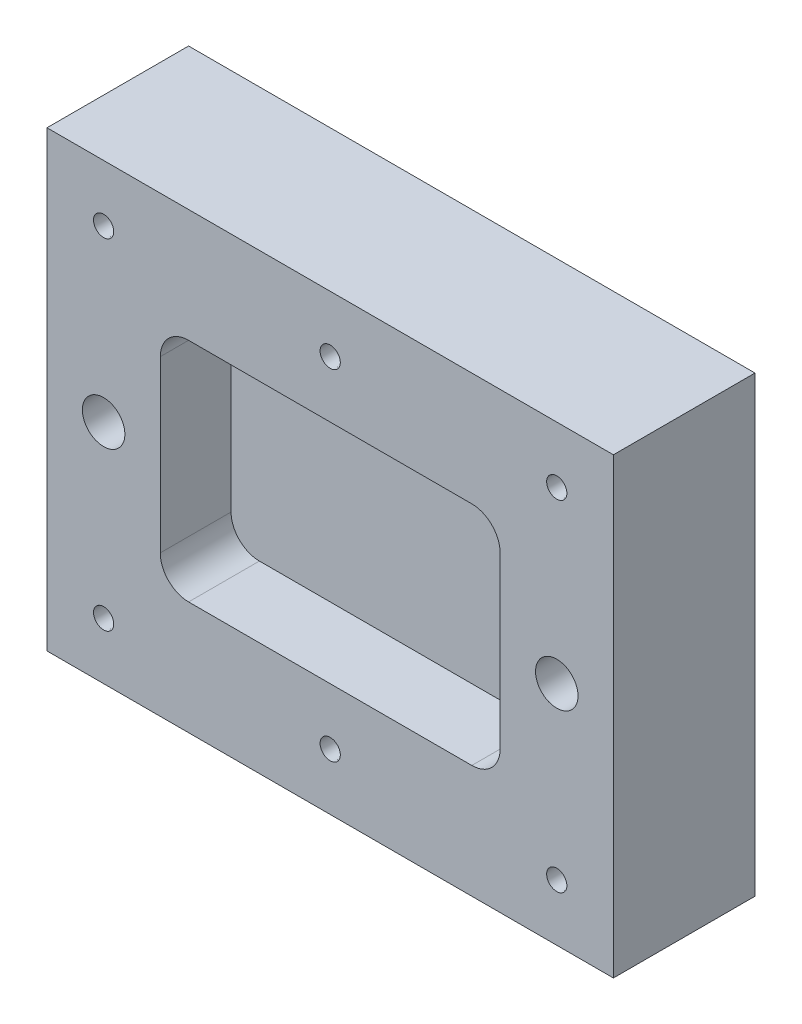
ISO-10303-21;
HEADER;
FILE_DESCRIPTION(('STEP AP214'),'2;1');
FILE_NAME('part.step','',(''),(''),'','','');
FILE_SCHEMA(('AUTOMOTIVE_DESIGN { 1 0 10303 214 1 1 1 1 }'));
ENDSEC;
DATA;
#1=APPLICATION_CONTEXT('core data for automotive mechanical design processes');
#2=APPLICATION_PROTOCOL_DEFINITION('international standard','automotive_design',2000,#1);
#3=PRODUCT_CONTEXT('',#1,'mechanical');
#4=PRODUCT('Part','Part','',(#3));
#5=PRODUCT_RELATED_PRODUCT_CATEGORY('part','',(#4));
#6=PRODUCT_DEFINITION_FORMATION('','',#4);
#7=PRODUCT_DEFINITION_CONTEXT('part definition',#1,'design');
#8=PRODUCT_DEFINITION('design','',#6,#7);
#9=PRODUCT_DEFINITION_SHAPE('','',#8);
#10=(LENGTH_UNIT() NAMED_UNIT(*) SI_UNIT(.MILLI.,.METRE.));
#11=(NAMED_UNIT(*) PLANE_ANGLE_UNIT() SI_UNIT($,.RADIAN.));
#12=(NAMED_UNIT(*) SI_UNIT($,.STERADIAN.) SOLID_ANGLE_UNIT());
#13=UNCERTAINTY_MEASURE_WITH_UNIT(LENGTH_MEASURE(1.E-05),#10,'distance_accuracy_value','');
#14=(GEOMETRIC_REPRESENTATION_CONTEXT(3) GLOBAL_UNCERTAINTY_ASSIGNED_CONTEXT((#13)) GLOBAL_UNIT_ASSIGNED_CONTEXT((#10,
#11,#12)) REPRESENTATION_CONTEXT('',''));
#15=CARTESIAN_POINT('',(0.,0.,0.));
#16=DIRECTION('',(0.,0.,1.));
#17=DIRECTION('',(1.,0.,0.));
#18=AXIS2_PLACEMENT_3D('',#15,#16,#17);
#19=CARTESIAN_POINT('',(-100.,-80.,-50.));
#20=DIRECTION('',(0.,0.,-1.));
#21=DIRECTION('',(-1.,0.,0.));
#22=AXIS2_PLACEMENT_3D('',#19,#20,#21);
#23=PLANE('',#22);
#24=CARTESIAN_POINT('',(-80.,0.,-50.));
#25=DIRECTION('',(0.,0.,1.));
#26=DIRECTION('',(1.,0.,0.));
#27=AXIS2_PLACEMENT_3D('',#24,#25,#26);
#28=CIRCLE('',#27,7.5);
#29=CARTESIAN_POINT('',(-72.5,0.,-50.));
#30=VERTEX_POINT('',#29);
#31=EDGE_CURVE('E1040',#30,#30,#28,.T.);
#32=ORIENTED_EDGE('',*,*,#31,.T.);
#33=EDGE_LOOP('',(#32));
#34=FACE_BOUND('',#33,.T.);
#35=CARTESIAN_POINT('',(80.,0.,-50.));
#36=DIRECTION('',(0.,0.,1.));
#37=DIRECTION('',(1.,0.,0.));
#38=AXIS2_PLACEMENT_3D('',#35,#36,#37);
#39=CIRCLE('',#38,7.5);
#40=CARTESIAN_POINT('',(87.5,0.,-50.));
#41=VERTEX_POINT('',#40);
#42=EDGE_CURVE('E1006',#41,#41,#39,.T.);
#43=ORIENTED_EDGE('',*,*,#42,.T.);
#44=EDGE_LOOP('',(#43));
#45=FACE_BOUND('',#44,.T.);
#46=CARTESIAN_POINT('',(-80.,60.,-50.));
#47=DIRECTION('',(0.,0.,1.));
#48=DIRECTION('',(1.,0.,0.));
#49=AXIS2_PLACEMENT_3D('',#46,#47,#48);
#50=CIRCLE('',#49,3.0734);
#51=CARTESIAN_POINT('',(-76.9266,60.,-50.));
#52=VERTEX_POINT('',#51);
#53=EDGE_CURVE('E287',#52,#52,#50,.T.);
#54=ORIENTED_EDGE('',*,*,#53,.T.);
#55=EDGE_LOOP('',(#54));
#56=FACE_BOUND('',#55,.T.);
#57=CARTESIAN_POINT('',(80.,60.,-50.));
#58=DIRECTION('',(0.,0.,1.));
#59=DIRECTION('',(1.,0.,0.));
#60=AXIS2_PLACEMENT_3D('',#57,#58,#59);
#61=CIRCLE('',#60,3.0734);
#62=CARTESIAN_POINT('',(83.0734,60.,-50.));
#63=VERTEX_POINT('',#62);
#64=EDGE_CURVE('E360',#63,#63,#61,.T.);
#65=ORIENTED_EDGE('',*,*,#64,.T.);
#66=EDGE_LOOP('',(#65));
#67=FACE_BOUND('',#66,.T.);
#68=CARTESIAN_POINT('',(80.,-60.,-50.));
#69=DIRECTION('',(0.,0.,1.));
#70=DIRECTION('',(1.,0.,0.));
#71=AXIS2_PLACEMENT_3D('',#68,#69,#70);
#72=CIRCLE('',#71,3.0734);
#73=CARTESIAN_POINT('',(83.0734,-60.,-50.));
#74=VERTEX_POINT('',#73);
#75=EDGE_CURVE('E342',#74,#74,#72,.T.);
#76=ORIENTED_EDGE('',*,*,#75,.T.);
#77=EDGE_LOOP('',(#76));
#78=FACE_BOUND('',#77,.T.);
#79=DIRECTION('',(0.,-1.,0.));
#80=VECTOR('',#79,1.);
#81=CARTESIAN_POINT('',(-100.,80.,-50.));
#82=LINE('',#81,#80);
#83=CARTESIAN_POINT('',(-100.,80.,-50.));
#84=VERTEX_POINT('',#83);
#85=CARTESIAN_POINT('',(-100.,-80.,-50.));
#86=VERTEX_POINT('',#85);
#87=EDGE_CURVE('E191',#84,#86,#82,.T.);
#88=ORIENTED_EDGE('',*,*,#87,.F.);
#89=DIRECTION('',(1.,0.,0.));
#90=VECTOR('',#89,1.);
#91=CARTESIAN_POINT('',(-100.,80.,-50.));
#92=LINE('',#91,#90);
#93=CARTESIAN_POINT('',(100.,80.,-50.));
#94=VERTEX_POINT('',#93);
#95=EDGE_CURVE('E202',#84,#94,#92,.T.);
#96=ORIENTED_EDGE('',*,*,#95,.T.);
#97=DIRECTION('',(0.,1.,0.));
#98=VECTOR('',#97,1.);
#99=CARTESIAN_POINT('',(100.,-80.,-50.));
#100=LINE('',#99,#98);
#101=CARTESIAN_POINT('',(100.,-80.,-50.));
#102=VERTEX_POINT('',#101);
#103=EDGE_CURVE('E203',#102,#94,#100,.T.);
#104=ORIENTED_EDGE('',*,*,#103,.F.);
#105=DIRECTION('',(-1.,0.,0.));
#106=VECTOR('',#105,1.);
#107=CARTESIAN_POINT('',(100.,-80.,-50.));
#108=LINE('',#107,#106);
#109=EDGE_CURVE('E109',#102,#86,#108,.T.);
#110=ORIENTED_EDGE('',*,*,#109,.T.);
#111=EDGE_LOOP('',(#88,#96,#104,#110));
#112=FACE_BOUND('',#111,.T.);
#113=CARTESIAN_POINT('',(0.,60.,-50.));
#114=DIRECTION('',(0.,0.,1.));
#115=DIRECTION('',(1.,0.,0.));
#116=AXIS2_PLACEMENT_3D('',#113,#114,#115);
#117=CIRCLE('',#116,3.0734);
#118=CARTESIAN_POINT('',(3.07340000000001,60.,-50.));
#119=VERTEX_POINT('',#118);
#120=EDGE_CURVE('E239',#119,#119,#117,.T.);
#121=ORIENTED_EDGE('',*,*,#120,.T.);
#122=EDGE_LOOP('',(#121));
#123=FACE_BOUND('',#122,.T.);
#124=CARTESIAN_POINT('',(0.,-60.,-50.));
#125=DIRECTION('',(0.,0.,1.));
#126=DIRECTION('',(1.,0.,0.));
#127=AXIS2_PLACEMENT_3D('',#124,#125,#126);
#128=CIRCLE('',#127,3.0734);
#129=CARTESIAN_POINT('',(3.07340000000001,-60.,-50.));
#130=VERTEX_POINT('',#129);
#131=EDGE_CURVE('E243',#130,#130,#128,.T.);
#132=ORIENTED_EDGE('',*,*,#131,.T.);
#133=EDGE_LOOP('',(#132));
#134=FACE_BOUND('',#133,.T.);
#135=CARTESIAN_POINT('',(-80.,-60.,-50.));
#136=DIRECTION('',(0.,0.,1.));
#137=DIRECTION('',(1.,0.,0.));
#138=AXIS2_PLACEMENT_3D('',#135,#136,#137);
#139=CIRCLE('',#138,3.0734);
#140=CARTESIAN_POINT('',(-76.9266,-60.,-50.));
#141=VERTEX_POINT('',#140);
#142=EDGE_CURVE('E248',#141,#141,#139,.T.);
#143=ORIENTED_EDGE('',*,*,#142,.T.);
#144=EDGE_LOOP('',(#143));
#145=FACE_BOUND('',#144,.T.);
#146=ADVANCED_FACE('F59',(#34,#45,#56,#67,#78,#112,#123,#134,#145),#23,.T.);
#147=CARTESIAN_POINT('',(-100.,-80.,0.));
#148=DIRECTION('',(0.,0.,-1.));
#149=DIRECTION('',(-1.,0.,0.));
#150=AXIS2_PLACEMENT_3D('',#147,#148,#149);
#151=PLANE('',#150);
#152=CARTESIAN_POINT('',(-80.,0.,0.));
#153=DIRECTION('',(0.,0.,1.));
#154=DIRECTION('',(1.,0.,0.));
#155=AXIS2_PLACEMENT_3D('',#152,#153,#154);
#156=CIRCLE('',#155,7.5);
#157=CARTESIAN_POINT('',(-72.5,0.,0.));
#158=VERTEX_POINT('',#157);
#159=EDGE_CURVE('E1010',#158,#158,#156,.T.);
#160=ORIENTED_EDGE('',*,*,#159,.F.);
#161=EDGE_LOOP('',(#160));
#162=FACE_BOUND('',#161,.T.);
#163=CARTESIAN_POINT('',(80.,0.,0.));
#164=DIRECTION('',(0.,0.,1.));
#165=DIRECTION('',(1.,0.,0.));
#166=AXIS2_PLACEMENT_3D('',#163,#164,#165);
#167=CIRCLE('',#166,7.5);
#168=CARTESIAN_POINT('',(87.5,0.,0.));
#169=VERTEX_POINT('',#168);
#170=EDGE_CURVE('E1004',#169,#169,#167,.T.);
#171=ORIENTED_EDGE('',*,*,#170,.F.);
#172=EDGE_LOOP('',(#171));
#173=FACE_BOUND('',#172,.T.);
#174=CARTESIAN_POINT('',(-80.,60.,0.));
#175=DIRECTION('',(0.,0.,1.));
#176=DIRECTION('',(1.,0.,0.));
#177=AXIS2_PLACEMENT_3D('',#174,#175,#176);
#178=CIRCLE('',#177,3.571113);
#179=CARTESIAN_POINT('',(-76.428887,60.,0.));
#180=VERTEX_POINT('',#179);
#181=EDGE_CURVE('E282',#180,#180,#178,.T.);
#182=ORIENTED_EDGE('',*,*,#181,.F.);
#183=EDGE_LOOP('',(#182));
#184=FACE_BOUND('',#183,.T.);
#185=CARTESIAN_POINT('',(80.,60.,0.));
#186=DIRECTION('',(0.,0.,1.));
#187=DIRECTION('',(1.,0.,0.));
#188=AXIS2_PLACEMENT_3D('',#185,#186,#187);
#189=CIRCLE('',#188,3.571113);
#190=CARTESIAN_POINT('',(83.571113,60.,0.));
#191=VERTEX_POINT('',#190);
#192=EDGE_CURVE('E354',#191,#191,#189,.T.);
#193=ORIENTED_EDGE('',*,*,#192,.F.);
#194=EDGE_LOOP('',(#193));
#195=FACE_BOUND('',#194,.T.);
#196=CARTESIAN_POINT('',(80.,-60.,0.));
#197=DIRECTION('',(0.,0.,1.));
#198=DIRECTION('',(1.,0.,0.));
#199=AXIS2_PLACEMENT_3D('',#196,#197,#198);
#200=CIRCLE('',#199,3.571113);
#201=CARTESIAN_POINT('',(83.571113,-60.,0.));
#202=VERTEX_POINT('',#201);
#203=EDGE_CURVE('E337',#202,#202,#200,.T.);
#204=ORIENTED_EDGE('',*,*,#203,.F.);
#205=EDGE_LOOP('',(#204));
#206=FACE_BOUND('',#205,.T.);
#207=CARTESIAN_POINT('',(-80.,-60.,0.));
#208=DIRECTION('',(0.,0.,1.));
#209=DIRECTION('',(1.,0.,0.));
#210=AXIS2_PLACEMENT_3D('',#207,#208,#209);
#211=CIRCLE('',#210,3.571113);
#212=CARTESIAN_POINT('',(-76.428887,-60.,0.));
#213=VERTEX_POINT('',#212);
#214=EDGE_CURVE('E378',#213,#213,#211,.T.);
#215=ORIENTED_EDGE('',*,*,#214,.F.);
#216=EDGE_LOOP('',(#215));
#217=FACE_BOUND('',#216,.T.);
#218=CARTESIAN_POINT('',(0.,-60.,0.));
#219=DIRECTION('',(0.,0.,1.));
#220=DIRECTION('',(1.,0.,0.));
#221=AXIS2_PLACEMENT_3D('',#218,#219,#220);
#222=CIRCLE('',#221,3.571113);
#223=CARTESIAN_POINT('',(3.57111300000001,-60.,0.));
#224=VERTEX_POINT('',#223);
#225=EDGE_CURVE('E250',#224,#224,#222,.T.);
#226=ORIENTED_EDGE('',*,*,#225,.F.);
#227=EDGE_LOOP('',(#226));
#228=FACE_BOUND('',#227,.T.);
#229=CARTESIAN_POINT('',(0.,60.,0.));
#230=DIRECTION('',(0.,0.,1.));
#231=DIRECTION('',(1.,0.,0.));
#232=AXIS2_PLACEMENT_3D('',#229,#230,#231);
#233=CIRCLE('',#232,3.571113);
#234=CARTESIAN_POINT('',(3.57111300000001,60.,0.));
#235=VERTEX_POINT('',#234);
#236=EDGE_CURVE('E320',#235,#235,#233,.T.);
#237=ORIENTED_EDGE('',*,*,#236,.F.);
#238=EDGE_LOOP('',(#237));
#239=FACE_BOUND('',#238,.T.);
#240=DIRECTION('',(0.,-1.,0.));
#241=VECTOR('',#240,1.);
#242=CARTESIAN_POINT('',(-100.,80.,0.));
#243=LINE('',#242,#241);
#244=CARTESIAN_POINT('',(-100.,80.,0.));
#245=VERTEX_POINT('',#244);
#246=CARTESIAN_POINT('',(-100.,-80.,0.));
#247=VERTEX_POINT('',#246);
#248=EDGE_CURVE('E181',#245,#247,#243,.T.);
#249=ORIENTED_EDGE('',*,*,#248,.T.);
#250=DIRECTION('',(-1.,0.,0.));
#251=VECTOR('',#250,1.);
#252=CARTESIAN_POINT('',(100.,-80.,0.));
#253=LINE('',#252,#251);
#254=CARTESIAN_POINT('',(100.,-80.,0.));
#255=VERTEX_POINT('',#254);
#256=EDGE_CURVE('E189',#255,#247,#253,.T.);
#257=ORIENTED_EDGE('',*,*,#256,.F.);
#258=DIRECTION('',(0.,1.,0.));
#259=VECTOR('',#258,1.);
#260=CARTESIAN_POINT('',(100.,-80.,0.));
#261=LINE('',#260,#259);
#262=CARTESIAN_POINT('',(100.,80.,0.));
#263=VERTEX_POINT('',#262);
#264=EDGE_CURVE('E211',#255,#263,#261,.T.);
#265=ORIENTED_EDGE('',*,*,#264,.T.);
#266=DIRECTION('',(1.,0.,0.));
#267=VECTOR('',#266,1.);
#268=CARTESIAN_POINT('',(-100.,80.,0.));
#269=LINE('',#268,#267);
#270=EDGE_CURVE('E196',#245,#263,#269,.T.);
#271=ORIENTED_EDGE('',*,*,#270,.F.);
#272=EDGE_LOOP('',(#249,#257,#265,#271));
#273=FACE_BOUND('',#272,.T.);
#274=CARTESIAN_POINT('',(-50.,30.,0.));
#275=DIRECTION('',(0.,0.,-1.));
#276=DIRECTION('',(-1.,0.,0.));
#277=AXIS2_PLACEMENT_3D('',#274,#275,#276);
#278=CIRCLE('',#277,10.);
#279=CARTESIAN_POINT('',(-60.,29.9999999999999,0.));
#280=VERTEX_POINT('',#279);
#281=CARTESIAN_POINT('',(-49.9999999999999,40.,0.));
#282=VERTEX_POINT('',#281);
#283=EDGE_CURVE('E77',#280,#282,#278,.T.);
#284=ORIENTED_EDGE('',*,*,#283,.T.);
#285=DIRECTION('',(1.,0.,0.));
#286=VECTOR('',#285,1.);
#287=CARTESIAN_POINT('',(-49.9999999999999,40.,0.));
#288=LINE('',#287,#286);
#289=CARTESIAN_POINT('',(49.9999999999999,40.,0.));
#290=VERTEX_POINT('',#289);
#291=EDGE_CURVE('E182',#282,#290,#288,.T.);
#292=ORIENTED_EDGE('',*,*,#291,.T.);
#293=CARTESIAN_POINT('',(50.,30.,0.));
#294=DIRECTION('',(0.,0.,1.));
#295=DIRECTION('',(1.,0.,0.));
#296=AXIS2_PLACEMENT_3D('',#293,#294,#295);
#297=CIRCLE('',#296,10.);
#298=CARTESIAN_POINT('',(60.,29.9999999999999,0.));
#299=VERTEX_POINT('',#298);
#300=EDGE_CURVE('E392',#299,#290,#297,.T.);
#301=ORIENTED_EDGE('',*,*,#300,.F.);
#302=DIRECTION('',(0.,1.,0.));
#303=VECTOR('',#302,1.);
#304=CARTESIAN_POINT('',(60.,-29.9999999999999,0.));
#305=LINE('',#304,#303);
#306=CARTESIAN_POINT('',(60.,-29.9999999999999,0.));
#307=VERTEX_POINT('',#306);
#308=EDGE_CURVE('E391',#307,#299,#305,.T.);
#309=ORIENTED_EDGE('',*,*,#308,.F.);
#310=CARTESIAN_POINT('',(50.,-30.,0.));
#311=DIRECTION('',(0.,0.,-1.));
#312=DIRECTION('',(-1.,0.,0.));
#313=AXIS2_PLACEMENT_3D('',#310,#311,#312);
#314=CIRCLE('',#313,10.);
#315=CARTESIAN_POINT('',(49.9999999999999,-40.,0.));
#316=VERTEX_POINT('',#315);
#317=EDGE_CURVE('E400',#307,#316,#314,.T.);
#318=ORIENTED_EDGE('',*,*,#317,.T.);
#319=DIRECTION('',(-1.,0.,0.));
#320=VECTOR('',#319,1.);
#321=CARTESIAN_POINT('',(49.9999999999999,-40.,0.));
#322=LINE('',#321,#320);
#323=CARTESIAN_POINT('',(-49.9999999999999,-40.,0.));
#324=VERTEX_POINT('',#323);
#325=EDGE_CURVE('E401',#316,#324,#322,.T.);
#326=ORIENTED_EDGE('',*,*,#325,.T.);
#327=CARTESIAN_POINT('',(-50.,-30.,0.));
#328=DIRECTION('',(0.,0.,-1.));
#329=DIRECTION('',(-1.,0.,0.));
#330=AXIS2_PLACEMENT_3D('',#327,#328,#329);
#331=CIRCLE('',#330,10.);
#332=CARTESIAN_POINT('',(-60.,-29.9999999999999,0.));
#333=VERTEX_POINT('',#332);
#334=EDGE_CURVE('E410',#324,#333,#331,.T.);
#335=ORIENTED_EDGE('',*,*,#334,.T.);
#336=DIRECTION('',(0.,-1.,0.));
#337=VECTOR('',#336,1.);
#338=CARTESIAN_POINT('',(-60.,29.9999999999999,0.));
#339=LINE('',#338,#337);
#340=EDGE_CURVE('E179',#280,#333,#339,.T.);
#341=ORIENTED_EDGE('',*,*,#340,.F.);
#342=EDGE_LOOP('',(#284,#292,#301,#309,#318,#326,#335,#341));
#343=FACE_BOUND('',#342,.T.);
#344=ADVANCED_FACE('F227',(#162,#173,#184,#195,#206,#217,#228,#239,#273,#343),#151,.F.);
#345=CARTESIAN_POINT('',(-100.,80.,-50.));
#346=DIRECTION('',(-1.,0.,0.));
#347=DIRECTION('',(0.,0.,1.));
#348=AXIS2_PLACEMENT_3D('',#345,#346,#347);
#349=PLANE('',#348);
#350=ORIENTED_EDGE('',*,*,#248,.F.);
#351=DIRECTION('',(0.,0.,1.));
#352=VECTOR('',#351,1.);
#353=CARTESIAN_POINT('',(-100.,80.,-50.));
#354=LINE('',#353,#352);
#355=EDGE_CURVE('E12',#84,#245,#354,.T.);
#356=ORIENTED_EDGE('',*,*,#355,.F.);
#357=ORIENTED_EDGE('',*,*,#87,.T.);
#358=DIRECTION('',(0.,0.,1.));
#359=VECTOR('',#358,1.);
#360=CARTESIAN_POINT('',(-100.,-80.,-50.));
#361=LINE('',#360,#359);
#362=EDGE_CURVE('E65',#86,#247,#361,.T.);
#363=ORIENTED_EDGE('',*,*,#362,.T.);
#364=EDGE_LOOP('',(#350,#356,#357,#363));
#365=FACE_BOUND('',#364,.T.);
#366=ADVANCED_FACE('F58',(#365),#349,.T.);
#367=CARTESIAN_POINT('',(-100.,80.,-50.));
#368=DIRECTION('',(0.,-1.,0.));
#369=DIRECTION('',(0.,0.,-1.));
#370=AXIS2_PLACEMENT_3D('',#367,#368,#369);
#371=PLANE('',#370);
#372=ORIENTED_EDGE('',*,*,#270,.T.);
#373=DIRECTION('',(0.,0.,1.));
#374=VECTOR('',#373,1.);
#375=CARTESIAN_POINT('',(100.,80.,-50.));
#376=LINE('',#375,#374);
#377=EDGE_CURVE('E67',#94,#263,#376,.T.);
#378=ORIENTED_EDGE('',*,*,#377,.F.);
#379=ORIENTED_EDGE('',*,*,#95,.F.);
#380=ORIENTED_EDGE('',*,*,#355,.T.);
#381=EDGE_LOOP('',(#372,#378,#379,#380));
#382=FACE_BOUND('',#381,.T.);
#383=ADVANCED_FACE('F229',(#382),#371,.F.);
#384=CARTESIAN_POINT('',(100.,-80.,-50.));
#385=DIRECTION('',(1.,0.,0.));
#386=DIRECTION('',(0.,0.,-1.));
#387=AXIS2_PLACEMENT_3D('',#384,#385,#386);
#388=PLANE('',#387);
#389=ORIENTED_EDGE('',*,*,#264,.F.);
#390=DIRECTION('',(0.,0.,1.));
#391=VECTOR('',#390,1.);
#392=CARTESIAN_POINT('',(100.,-80.,-50.));
#393=LINE('',#392,#391);
#394=EDGE_CURVE('E217',#102,#255,#393,.T.);
#395=ORIENTED_EDGE('',*,*,#394,.F.);
#396=ORIENTED_EDGE('',*,*,#103,.T.);
#397=ORIENTED_EDGE('',*,*,#377,.T.);
#398=EDGE_LOOP('',(#389,#395,#396,#397));
#399=FACE_BOUND('',#398,.T.);
#400=ADVANCED_FACE('F233',(#399),#388,.T.);
#401=CARTESIAN_POINT('',(100.,-80.,-50.));
#402=DIRECTION('',(0.,1.,0.));
#403=DIRECTION('',(0.,0.,1.));
#404=AXIS2_PLACEMENT_3D('',#401,#402,#403);
#405=PLANE('',#404);
#406=ORIENTED_EDGE('',*,*,#256,.T.);
#407=ORIENTED_EDGE('',*,*,#362,.F.);
#408=ORIENTED_EDGE('',*,*,#109,.F.);
#409=ORIENTED_EDGE('',*,*,#394,.T.);
#410=EDGE_LOOP('',(#406,#407,#408,#409));
#411=FACE_BOUND('',#410,.T.);
#412=ADVANCED_FACE('F224',(#411),#405,.F.);
#413=CARTESIAN_POINT('',(-50.,30.,-25.));
#414=DIRECTION('',(0.,0.,1.));
#415=DIRECTION('',(1.,0.,0.));
#416=AXIS2_PLACEMENT_3D('',#413,#414,#415);
#417=CYLINDRICAL_SURFACE('',#416,10.);
#418=ORIENTED_EDGE('',*,*,#283,.F.);
#419=DIRECTION('',(0.,0.,1.));
#420=VECTOR('',#419,1.);
#421=CARTESIAN_POINT('',(-60.,29.9999999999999,-25.));
#422=LINE('',#421,#420);
#423=CARTESIAN_POINT('',(-60.,29.9999999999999,-25.));
#424=VERTEX_POINT('',#423);
#425=EDGE_CURVE('E171',#424,#280,#422,.T.);
#426=ORIENTED_EDGE('',*,*,#425,.F.);
#427=CARTESIAN_POINT('',(-50.,30.,-25.));
#428=DIRECTION('',(0.,0.,-1.));
#429=DIRECTION('',(-1.,0.,0.));
#430=AXIS2_PLACEMENT_3D('',#427,#428,#429);
#431=CIRCLE('',#430,10.);
#432=CARTESIAN_POINT('',(-49.9999999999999,40.,-25.));
#433=VERTEX_POINT('',#432);
#434=EDGE_CURVE('E162',#424,#433,#431,.T.);
#435=ORIENTED_EDGE('',*,*,#434,.T.);
#436=DIRECTION('',(0.,0.,1.));
#437=VECTOR('',#436,1.);
#438=CARTESIAN_POINT('',(-49.9999999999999,40.,-25.));
#439=LINE('',#438,#437);
#440=EDGE_CURVE('E174',#433,#282,#439,.T.);
#441=ORIENTED_EDGE('',*,*,#440,.T.);
#442=EDGE_LOOP('',(#418,#426,#435,#441));
#443=FACE_BOUND('',#442,.T.);
#444=ADVANCED_FACE('F173',(#443),#417,.F.);
#445=CARTESIAN_POINT('',(-49.9999999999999,40.,-25.));
#446=DIRECTION('',(0.,-1.,0.));
#447=DIRECTION('',(0.,0.,-1.));
#448=AXIS2_PLACEMENT_3D('',#445,#446,#447);
#449=PLANE('',#448);
#450=ORIENTED_EDGE('',*,*,#291,.F.);
#451=ORIENTED_EDGE('',*,*,#440,.F.);
#452=DIRECTION('',(1.,0.,0.));
#453=VECTOR('',#452,1.);
#454=CARTESIAN_POINT('',(-49.9999999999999,40.,-25.));
#455=LINE('',#454,#453);
#456=CARTESIAN_POINT('',(49.9999999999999,40.,-25.));
#457=VERTEX_POINT('',#456);
#458=EDGE_CURVE('E157',#433,#457,#455,.T.);
#459=ORIENTED_EDGE('',*,*,#458,.T.);
#460=DIRECTION('',(0.,0.,1.));
#461=VECTOR('',#460,1.);
#462=CARTESIAN_POINT('',(49.9999999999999,40.,-25.));
#463=LINE('',#462,#461);
#464=EDGE_CURVE('E184',#457,#290,#463,.T.);
#465=ORIENTED_EDGE('',*,*,#464,.T.);
#466=EDGE_LOOP('',(#450,#451,#459,#465));
#467=FACE_BOUND('',#466,.T.);
#468=ADVANCED_FACE('F180',(#467),#449,.T.);
#469=CARTESIAN_POINT('',(50.,30.,-25.));
#470=DIRECTION('',(0.,0.,1.));
#471=DIRECTION('',(1.,0.,0.));
#472=AXIS2_PLACEMENT_3D('',#469,#470,#471);
#473=CYLINDRICAL_SURFACE('',#472,10.);
#474=ORIENTED_EDGE('',*,*,#300,.T.);
#475=ORIENTED_EDGE('',*,*,#464,.F.);
#476=CARTESIAN_POINT('',(50.,30.,-25.));
#477=DIRECTION('',(0.,0.,1.));
#478=DIRECTION('',(1.,0.,0.));
#479=AXIS2_PLACEMENT_3D('',#476,#477,#478);
#480=CIRCLE('',#479,10.);
#481=CARTESIAN_POINT('',(60.,29.9999999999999,-25.));
#482=VERTEX_POINT('',#481);
#483=EDGE_CURVE('E170',#482,#457,#480,.T.);
#484=ORIENTED_EDGE('',*,*,#483,.F.);
#485=DIRECTION('',(0.,0.,1.));
#486=VECTOR('',#485,1.);
#487=CARTESIAN_POINT('',(60.,29.9999999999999,-25.));
#488=LINE('',#487,#486);
#489=EDGE_CURVE('E193',#482,#299,#488,.T.);
#490=ORIENTED_EDGE('',*,*,#489,.T.);
#491=EDGE_LOOP('',(#474,#475,#484,#490));
#492=FACE_BOUND('',#491,.T.);
#493=ADVANCED_FACE('F450',(#492),#473,.F.);
#494=CARTESIAN_POINT('',(60.,-29.9999999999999,-25.));
#495=DIRECTION('',(1.,0.,0.));
#496=DIRECTION('',(0.,0.,-1.));
#497=AXIS2_PLACEMENT_3D('',#494,#495,#496);
#498=PLANE('',#497);
#499=ORIENTED_EDGE('',*,*,#308,.T.);
#500=ORIENTED_EDGE('',*,*,#489,.F.);
#501=DIRECTION('',(0.,1.,0.));
#502=VECTOR('',#501,1.);
#503=CARTESIAN_POINT('',(60.,-29.9999999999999,-25.));
#504=LINE('',#503,#502);
#505=CARTESIAN_POINT('',(60.,-29.9999999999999,-25.));
#506=VERTEX_POINT('',#505);
#507=EDGE_CURVE('E418',#506,#482,#504,.T.);
#508=ORIENTED_EDGE('',*,*,#507,.F.);
#509=DIRECTION('',(0.,0.,1.));
#510=VECTOR('',#509,1.);
#511=CARTESIAN_POINT('',(60.,-29.9999999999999,-25.));
#512=LINE('',#511,#510);
#513=EDGE_CURVE('E445',#506,#307,#512,.T.);
#514=ORIENTED_EDGE('',*,*,#513,.T.);
#515=EDGE_LOOP('',(#499,#500,#508,#514));
#516=FACE_BOUND('',#515,.T.);
#517=ADVANCED_FACE('F454',(#516),#498,.F.);
#518=CARTESIAN_POINT('',(50.,-30.,-25.));
#519=DIRECTION('',(0.,0.,1.));
#520=DIRECTION('',(1.,0.,0.));
#521=AXIS2_PLACEMENT_3D('',#518,#519,#520);
#522=CYLINDRICAL_SURFACE('',#521,10.);
#523=ORIENTED_EDGE('',*,*,#317,.F.);
#524=ORIENTED_EDGE('',*,*,#513,.F.);
#525=CARTESIAN_POINT('',(50.,-30.,-25.));
#526=DIRECTION('',(0.,0.,-1.));
#527=DIRECTION('',(-1.,0.,0.));
#528=AXIS2_PLACEMENT_3D('',#525,#526,#527);
#529=CIRCLE('',#528,10.);
#530=CARTESIAN_POINT('',(49.9999999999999,-40.,-25.));
#531=VERTEX_POINT('',#530);
#532=EDGE_CURVE('E420',#506,#531,#529,.T.);
#533=ORIENTED_EDGE('',*,*,#532,.T.);
#534=DIRECTION('',(0.,0.,1.));
#535=VECTOR('',#534,1.);
#536=CARTESIAN_POINT('',(49.9999999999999,-40.,-25.));
#537=LINE('',#536,#535);
#538=EDGE_CURVE('E438',#531,#316,#537,.T.);
#539=ORIENTED_EDGE('',*,*,#538,.T.);
#540=EDGE_LOOP('',(#523,#524,#533,#539));
#541=FACE_BOUND('',#540,.T.);
#542=ADVANCED_FACE('F466',(#541),#522,.F.);
#543=CARTESIAN_POINT('',(49.9999999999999,-40.,-25.));
#544=DIRECTION('',(0.,1.,0.));
#545=DIRECTION('',(0.,0.,1.));
#546=AXIS2_PLACEMENT_3D('',#543,#544,#545);
#547=PLANE('',#546);
#548=ORIENTED_EDGE('',*,*,#325,.F.);
#549=ORIENTED_EDGE('',*,*,#538,.F.);
#550=DIRECTION('',(-1.,0.,0.));
#551=VECTOR('',#550,1.);
#552=CARTESIAN_POINT('',(49.9999999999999,-40.,-25.));
#553=LINE('',#552,#551);
#554=CARTESIAN_POINT('',(-49.9999999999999,-40.,-25.));
#555=VERTEX_POINT('',#554);
#556=EDGE_CURVE('E425',#531,#555,#553,.T.);
#557=ORIENTED_EDGE('',*,*,#556,.T.);
#558=DIRECTION('',(0.,0.,1.));
#559=VECTOR('',#558,1.);
#560=CARTESIAN_POINT('',(-49.9999999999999,-40.,-25.));
#561=LINE('',#560,#559);
#562=EDGE_CURVE('E436',#555,#324,#561,.T.);
#563=ORIENTED_EDGE('',*,*,#562,.T.);
#564=EDGE_LOOP('',(#548,#549,#557,#563));
#565=FACE_BOUND('',#564,.T.);
#566=ADVANCED_FACE('F469',(#565),#547,.T.);
#567=CARTESIAN_POINT('',(-50.,-30.,-25.));
#568=DIRECTION('',(0.,0.,1.));
#569=DIRECTION('',(1.,0.,0.));
#570=AXIS2_PLACEMENT_3D('',#567,#568,#569);
#571=CYLINDRICAL_SURFACE('',#570,10.);
#572=ORIENTED_EDGE('',*,*,#334,.F.);
#573=ORIENTED_EDGE('',*,*,#562,.F.);
#574=CARTESIAN_POINT('',(-50.,-30.,-25.));
#575=DIRECTION('',(0.,0.,-1.));
#576=DIRECTION('',(-1.,0.,0.));
#577=AXIS2_PLACEMENT_3D('',#574,#575,#576);
#578=CIRCLE('',#577,10.);
#579=CARTESIAN_POINT('',(-60.,-29.9999999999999,-25.));
#580=VERTEX_POINT('',#579);
#581=EDGE_CURVE('E422',#555,#580,#578,.T.);
#582=ORIENTED_EDGE('',*,*,#581,.T.);
#583=DIRECTION('',(0.,0.,1.));
#584=VECTOR('',#583,1.);
#585=CARTESIAN_POINT('',(-60.,-29.9999999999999,-25.));
#586=LINE('',#585,#584);
#587=EDGE_CURVE('E433',#580,#333,#586,.T.);
#588=ORIENTED_EDGE('',*,*,#587,.T.);
#589=EDGE_LOOP('',(#572,#573,#582,#588));
#590=FACE_BOUND('',#589,.T.);
#591=ADVANCED_FACE('F464',(#590),#571,.F.);
#592=CARTESIAN_POINT('',(-60.,29.9999999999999,-25.));
#593=DIRECTION('',(-1.,0.,0.));
#594=DIRECTION('',(0.,0.,1.));
#595=AXIS2_PLACEMENT_3D('',#592,#593,#594);
#596=PLANE('',#595);
#597=ORIENTED_EDGE('',*,*,#340,.T.);
#598=ORIENTED_EDGE('',*,*,#587,.F.);
#599=DIRECTION('',(0.,-1.,0.));
#600=VECTOR('',#599,1.);
#601=CARTESIAN_POINT('',(-60.,29.9999999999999,-25.));
#602=LINE('',#601,#600);
#603=EDGE_CURVE('E428',#424,#580,#602,.T.);
#604=ORIENTED_EDGE('',*,*,#603,.F.);
#605=ORIENTED_EDGE('',*,*,#425,.T.);
#606=EDGE_LOOP('',(#597,#598,#604,#605));
#607=FACE_BOUND('',#606,.T.);
#608=ADVANCED_FACE('F456',(#607),#596,.F.);
#609=CARTESIAN_POINT('',(-50.,30.,-25.));
#610=DIRECTION('',(0.,0.,-1.));
#611=DIRECTION('',(-1.,0.,0.));
#612=AXIS2_PLACEMENT_3D('',#609,#610,#611);
#613=PLANE('',#612);
#614=ORIENTED_EDGE('',*,*,#434,.F.);
#615=ORIENTED_EDGE('',*,*,#603,.T.);
#616=ORIENTED_EDGE('',*,*,#581,.F.);
#617=ORIENTED_EDGE('',*,*,#556,.F.);
#618=ORIENTED_EDGE('',*,*,#532,.F.);
#619=ORIENTED_EDGE('',*,*,#507,.T.);
#620=ORIENTED_EDGE('',*,*,#483,.T.);
#621=ORIENTED_EDGE('',*,*,#458,.F.);
#622=EDGE_LOOP('',(#614,#615,#616,#617,#618,#619,#620,#621));
#623=FACE_BOUND('',#622,.T.);
#624=ADVANCED_FACE('F161',(#623),#613,.F.);
#625=CARTESIAN_POINT('',(0.,60.,0.));
#626=DIRECTION('',(0.,0.,1.));
#627=DIRECTION('',(1.,0.,0.));
#628=AXIS2_PLACEMENT_3D('',#625,#626,#627);
#629=CYLINDRICAL_SURFACE('',#628,3.0734);
#630=ORIENTED_EDGE('',*,*,#120,.F.);
#631=EDGE_LOOP('',(#630));
#632=FACE_BOUND('',#631,.T.);
#633=CARTESIAN_POINT('',(0.,60.,-6.89));
#634=DIRECTION('',(0.,0.,1.));
#635=DIRECTION('',(1.,0.,0.));
#636=AXIS2_PLACEMENT_3D('',#633,#634,#635);
#637=CIRCLE('',#636,3.0734);
#638=CARTESIAN_POINT('',(3.07340000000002,60.,-6.89));
#639=VERTEX_POINT('',#638);
#640=EDGE_CURVE('E316',#639,#639,#637,.T.);
#641=ORIENTED_EDGE('',*,*,#640,.T.);
#642=EDGE_LOOP('',(#641));
#643=FACE_BOUND('',#642,.T.);
#644=ADVANCED_FACE('F532',(#632,#643),#629,.F.);
#645=CARTESIAN_POINT('',(3.07340000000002,60.,-6.89));
#646=DIRECTION('',(0.,0.,-1.));
#647=DIRECTION('',(-1.,0.,0.));
#648=AXIS2_PLACEMENT_3D('',#645,#646,#647);
#649=PLANE('',#648);
#650=ORIENTED_EDGE('',*,*,#640,.F.);
#651=EDGE_LOOP('',(#650));
#652=FACE_BOUND('',#651,.T.);
#653=CARTESIAN_POINT('',(0.,60.,-6.89));
#654=DIRECTION('',(0.,0.,1.));
#655=DIRECTION('',(1.,0.,0.));
#656=AXIS2_PLACEMENT_3D('',#653,#654,#655);
#657=CIRCLE('',#656,3.3560124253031);
#658=CARTESIAN_POINT('',(3.35601242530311,60.,-6.89));
#659=VERTEX_POINT('',#658);
#660=EDGE_CURVE('E313',#659,#659,#657,.T.);
#661=ORIENTED_EDGE('',*,*,#660,.T.);
#662=EDGE_LOOP('',(#661));
#663=FACE_BOUND('',#662,.T.);
#664=ADVANCED_FACE('F706',(#652,#663),#649,.F.);
#665=CARTESIAN_POINT('',(0.,60.,0.));
#666=DIRECTION('',(0.,0.,1.));
#667=DIRECTION('',(1.,0.,0.));
#668=AXIS2_PLACEMENT_3D('',#665,#666,#667);
#669=CONICAL_SURFACE('',#668,3.571113,0.0312091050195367);
#670=ORIENTED_EDGE('',*,*,#660,.F.);
#671=EDGE_LOOP('',(#670));
#672=FACE_BOUND('',#671,.T.);
#673=ORIENTED_EDGE('',*,*,#236,.T.);
#674=EDGE_LOOP('',(#673));
#675=FACE_BOUND('',#674,.T.);
#676=ADVANCED_FACE('F700',(#672,#675),#669,.F.);
#677=CARTESIAN_POINT('',(0.,-60.,0.));
#678=DIRECTION('',(0.,0.,1.));
#679=DIRECTION('',(1.,0.,0.));
#680=AXIS2_PLACEMENT_3D('',#677,#678,#679);
#681=CYLINDRICAL_SURFACE('',#680,3.0734);
#682=ORIENTED_EDGE('',*,*,#131,.F.);
#683=EDGE_LOOP('',(#682));
#684=FACE_BOUND('',#683,.T.);
#685=CARTESIAN_POINT('',(0.,-60.,-6.89));
#686=DIRECTION('',(0.,0.,1.));
#687=DIRECTION('',(1.,0.,0.));
#688=AXIS2_PLACEMENT_3D('',#685,#686,#687);
#689=CIRCLE('',#688,3.0734);
#690=CARTESIAN_POINT('',(3.07340000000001,-60.,-6.89));
#691=VERTEX_POINT('',#690);
#692=EDGE_CURVE('E299',#691,#691,#689,.T.);
#693=ORIENTED_EDGE('',*,*,#692,.T.);
#694=EDGE_LOOP('',(#693));
#695=FACE_BOUND('',#694,.T.);
#696=ADVANCED_FACE('F687',(#684,#695),#681,.F.);
#697=CARTESIAN_POINT('',(3.07340000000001,-60.,-6.89));
#698=DIRECTION('',(0.,0.,-1.));
#699=DIRECTION('',(-1.,0.,0.));
#700=AXIS2_PLACEMENT_3D('',#697,#698,#699);
#701=PLANE('',#700);
#702=ORIENTED_EDGE('',*,*,#692,.F.);
#703=EDGE_LOOP('',(#702));
#704=FACE_BOUND('',#703,.T.);
#705=CARTESIAN_POINT('',(0.,-60.,-6.89));
#706=DIRECTION('',(0.,0.,1.));
#707=DIRECTION('',(1.,0.,0.));
#708=AXIS2_PLACEMENT_3D('',#705,#706,#707);
#709=CIRCLE('',#708,3.3560124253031);
#710=CARTESIAN_POINT('',(3.3560124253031,-60.,-6.89));
#711=VERTEX_POINT('',#710);
#712=EDGE_CURVE('E254',#711,#711,#709,.T.);
#713=ORIENTED_EDGE('',*,*,#712,.T.);
#714=EDGE_LOOP('',(#713));
#715=FACE_BOUND('',#714,.T.);
#716=ADVANCED_FACE('F679',(#704,#715),#701,.F.);
#717=CARTESIAN_POINT('',(0.,-60.,0.));
#718=DIRECTION('',(0.,0.,1.));
#719=DIRECTION('',(1.,0.,0.));
#720=AXIS2_PLACEMENT_3D('',#717,#718,#719);
#721=CONICAL_SURFACE('',#720,3.571113,0.0312091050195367);
#722=ORIENTED_EDGE('',*,*,#712,.F.);
#723=EDGE_LOOP('',(#722));
#724=FACE_BOUND('',#723,.T.);
#725=ORIENTED_EDGE('',*,*,#225,.T.);
#726=EDGE_LOOP('',(#725));
#727=FACE_BOUND('',#726,.T.);
#728=ADVANCED_FACE('F673',(#724,#727),#721,.F.);
#729=CARTESIAN_POINT('',(-80.,-60.,0.));
#730=DIRECTION('',(0.,0.,1.));
#731=DIRECTION('',(1.,0.,0.));
#732=AXIS2_PLACEMENT_3D('',#729,#730,#731);
#733=CYLINDRICAL_SURFACE('',#732,3.0734);
#734=ORIENTED_EDGE('',*,*,#142,.F.);
#735=EDGE_LOOP('',(#734));
#736=FACE_BOUND('',#735,.T.);
#737=CARTESIAN_POINT('',(-80.,-60.,-6.89));
#738=DIRECTION('',(0.,0.,1.));
#739=DIRECTION('',(1.,0.,0.));
#740=AXIS2_PLACEMENT_3D('',#737,#738,#739);
#741=CIRCLE('',#740,3.0734);
#742=CARTESIAN_POINT('',(-76.9266,-60.,-6.89));
#743=VERTEX_POINT('',#742);
#744=EDGE_CURVE('E246',#743,#743,#741,.T.);
#745=ORIENTED_EDGE('',*,*,#744,.T.);
#746=EDGE_LOOP('',(#745));
#747=FACE_BOUND('',#746,.T.);
#748=ADVANCED_FACE('F665',(#736,#747),#733,.F.);
#749=CARTESIAN_POINT('',(-76.9266,-60.,-6.89));
#750=DIRECTION('',(0.,0.,-1.));
#751=DIRECTION('',(-1.,0.,0.));
#752=AXIS2_PLACEMENT_3D('',#749,#750,#751);
#753=PLANE('',#752);
#754=ORIENTED_EDGE('',*,*,#744,.F.);
#755=EDGE_LOOP('',(#754));
#756=FACE_BOUND('',#755,.T.);
#757=CARTESIAN_POINT('',(-80.,-60.,-6.89));
#758=DIRECTION('',(0.,0.,1.));
#759=DIRECTION('',(1.,0.,0.));
#760=AXIS2_PLACEMENT_3D('',#757,#758,#759);
#761=CIRCLE('',#760,3.35601242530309);
#762=CARTESIAN_POINT('',(-76.6439875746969,-60.,-6.89));
#763=VERTEX_POINT('',#762);
#764=EDGE_CURVE('E256',#763,#763,#761,.T.);
#765=ORIENTED_EDGE('',*,*,#764,.T.);
#766=EDGE_LOOP('',(#765));
#767=FACE_BOUND('',#766,.T.);
#768=ADVANCED_FACE('F653',(#756,#767),#753,.F.);
#769=CARTESIAN_POINT('',(-80.,-60.,0.));
#770=DIRECTION('',(0.,0.,1.));
#771=DIRECTION('',(1.,0.,0.));
#772=AXIS2_PLACEMENT_3D('',#769,#770,#771);
#773=CONICAL_SURFACE('',#772,3.571113,0.0312091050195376);
#774=ORIENTED_EDGE('',*,*,#764,.F.);
#775=EDGE_LOOP('',(#774));
#776=FACE_BOUND('',#775,.T.);
#777=ORIENTED_EDGE('',*,*,#214,.T.);
#778=EDGE_LOOP('',(#777));
#779=FACE_BOUND('',#778,.T.);
#780=ADVANCED_FACE('F644',(#776,#779),#773,.F.);
#781=CARTESIAN_POINT('',(80.,-60.,0.));
#782=DIRECTION('',(0.,0.,1.));
#783=DIRECTION('',(1.,0.,0.));
#784=AXIS2_PLACEMENT_3D('',#781,#782,#783);
#785=CYLINDRICAL_SURFACE('',#784,3.0734);
#786=ORIENTED_EDGE('',*,*,#75,.F.);
#787=EDGE_LOOP('',(#786));
#788=FACE_BOUND('',#787,.T.);
#789=CARTESIAN_POINT('',(80.,-60.,-6.89));
#790=DIRECTION('',(0.,0.,1.));
#791=DIRECTION('',(1.,0.,0.));
#792=AXIS2_PLACEMENT_3D('',#789,#790,#791);
#793=CIRCLE('',#792,3.0734);
#794=CARTESIAN_POINT('',(83.0734,-60.,-6.89));
#795=VERTEX_POINT('',#794);
#796=EDGE_CURVE('E333',#795,#795,#793,.T.);
#797=ORIENTED_EDGE('',*,*,#796,.T.);
#798=EDGE_LOOP('',(#797));
#799=FACE_BOUND('',#798,.T.);
#800=ADVANCED_FACE('F631',(#788,#799),#785,.F.);
#801=CARTESIAN_POINT('',(83.0734,-60.,-6.89));
#802=DIRECTION('',(0.,0.,-1.));
#803=DIRECTION('',(-1.,0.,0.));
#804=AXIS2_PLACEMENT_3D('',#801,#802,#803);
#805=PLANE('',#804);
#806=ORIENTED_EDGE('',*,*,#796,.F.);
#807=EDGE_LOOP('',(#806));
#808=FACE_BOUND('',#807,.T.);
#809=CARTESIAN_POINT('',(80.,-60.,-6.89));
#810=DIRECTION('',(0.,0.,1.));
#811=DIRECTION('',(1.,0.,0.));
#812=AXIS2_PLACEMENT_3D('',#809,#810,#811);
#813=CIRCLE('',#812,3.35601242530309);
#814=CARTESIAN_POINT('',(83.3560124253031,-60.,-6.89));
#815=VERTEX_POINT('',#814);
#816=EDGE_CURVE('E329',#815,#815,#813,.T.);
#817=ORIENTED_EDGE('',*,*,#816,.T.);
#818=EDGE_LOOP('',(#817));
#819=FACE_BOUND('',#818,.T.);
#820=ADVANCED_FACE('F627',(#808,#819),#805,.F.);
#821=CARTESIAN_POINT('',(80.,-60.,0.));
#822=DIRECTION('',(0.,0.,1.));
#823=DIRECTION('',(1.,0.,0.));
#824=AXIS2_PLACEMENT_3D('',#821,#822,#823);
#825=CONICAL_SURFACE('',#824,3.571113,0.0312091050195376);
#826=ORIENTED_EDGE('',*,*,#816,.F.);
#827=EDGE_LOOP('',(#826));
#828=FACE_BOUND('',#827,.T.);
#829=ORIENTED_EDGE('',*,*,#203,.T.);
#830=EDGE_LOOP('',(#829));
#831=FACE_BOUND('',#830,.T.);
#832=ADVANCED_FACE('F369',(#828,#831),#825,.F.);
#833=CARTESIAN_POINT('',(80.,60.,0.));
#834=DIRECTION('',(0.,0.,1.));
#835=DIRECTION('',(1.,0.,0.));
#836=AXIS2_PLACEMENT_3D('',#833,#834,#835);
#837=CYLINDRICAL_SURFACE('',#836,3.0734);
#838=ORIENTED_EDGE('',*,*,#64,.F.);
#839=EDGE_LOOP('',(#838));
#840=FACE_BOUND('',#839,.T.);
#841=CARTESIAN_POINT('',(80.,60.,-6.89));
#842=DIRECTION('',(0.,0.,1.));
#843=DIRECTION('',(1.,0.,0.));
#844=AXIS2_PLACEMENT_3D('',#841,#842,#843);
#845=CIRCLE('',#844,3.0734);
#846=CARTESIAN_POINT('',(83.0734,60.,-6.89));
#847=VERTEX_POINT('',#846);
#848=EDGE_CURVE('E353',#847,#847,#845,.T.);
#849=ORIENTED_EDGE('',*,*,#848,.T.);
#850=EDGE_LOOP('',(#849));
#851=FACE_BOUND('',#850,.T.);
#852=ADVANCED_FACE('F606',(#840,#851),#837,.F.);
#853=CARTESIAN_POINT('',(83.0734,60.,-6.89));
#854=DIRECTION('',(0.,0.,-1.));
#855=DIRECTION('',(-1.,0.,0.));
#856=AXIS2_PLACEMENT_3D('',#853,#854,#855);
#857=PLANE('',#856);
#858=ORIENTED_EDGE('',*,*,#848,.F.);
#859=EDGE_LOOP('',(#858));
#860=FACE_BOUND('',#859,.T.);
#861=CARTESIAN_POINT('',(80.,60.,-6.89));
#862=DIRECTION('',(0.,0.,1.));
#863=DIRECTION('',(1.,0.,0.));
#864=AXIS2_PLACEMENT_3D('',#861,#862,#863);
#865=CIRCLE('',#864,3.35601242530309);
#866=CARTESIAN_POINT('',(83.3560124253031,60.,-6.89));
#867=VERTEX_POINT('',#866);
#868=EDGE_CURVE('E349',#867,#867,#865,.T.);
#869=ORIENTED_EDGE('',*,*,#868,.T.);
#870=EDGE_LOOP('',(#869));
#871=FACE_BOUND('',#870,.T.);
#872=ADVANCED_FACE('F599',(#860,#871),#857,.F.);
#873=CARTESIAN_POINT('',(80.,60.,0.));
#874=DIRECTION('',(0.,0.,1.));
#875=DIRECTION('',(1.,0.,0.));
#876=AXIS2_PLACEMENT_3D('',#873,#874,#875);
#877=CONICAL_SURFACE('',#876,3.571113,0.0312091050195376);
#878=ORIENTED_EDGE('',*,*,#868,.F.);
#879=EDGE_LOOP('',(#878));
#880=FACE_BOUND('',#879,.T.);
#881=ORIENTED_EDGE('',*,*,#192,.T.);
#882=EDGE_LOOP('',(#881));
#883=FACE_BOUND('',#882,.T.);
#884=ADVANCED_FACE('F591',(#880,#883),#877,.F.);
#885=CARTESIAN_POINT('',(-80.,60.,0.));
#886=DIRECTION('',(0.,0.,1.));
#887=DIRECTION('',(1.,0.,0.));
#888=AXIS2_PLACEMENT_3D('',#885,#886,#887);
#889=CYLINDRICAL_SURFACE('',#888,3.0734);
#890=ORIENTED_EDGE('',*,*,#53,.F.);
#891=EDGE_LOOP('',(#890));
#892=FACE_BOUND('',#891,.T.);
#893=CARTESIAN_POINT('',(-80.,60.,-6.89));
#894=DIRECTION('',(0.,0.,1.));
#895=DIRECTION('',(1.,0.,0.));
#896=AXIS2_PLACEMENT_3D('',#893,#894,#895);
#897=CIRCLE('',#896,3.0734);
#898=CARTESIAN_POINT('',(-76.9266,60.,-6.89));
#899=VERTEX_POINT('',#898);
#900=EDGE_CURVE('E278',#899,#899,#897,.T.);
#901=ORIENTED_EDGE('',*,*,#900,.T.);
#902=EDGE_LOOP('',(#901));
#903=FACE_BOUND('',#902,.T.);
#904=ADVANCED_FACE('F582',(#892,#903),#889,.F.);
#905=CARTESIAN_POINT('',(-76.9266,60.,-6.89));
#906=DIRECTION('',(0.,0.,-1.));
#907=DIRECTION('',(-1.,0.,0.));
#908=AXIS2_PLACEMENT_3D('',#905,#906,#907);
#909=PLANE('',#908);
#910=ORIENTED_EDGE('',*,*,#900,.F.);
#911=EDGE_LOOP('',(#910));
#912=FACE_BOUND('',#911,.T.);
#913=CARTESIAN_POINT('',(-80.,60.,-6.89));
#914=DIRECTION('',(0.,0.,1.));
#915=DIRECTION('',(1.,0.,0.));
#916=AXIS2_PLACEMENT_3D('',#913,#914,#915);
#917=CIRCLE('',#916,3.35601242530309);
#918=CARTESIAN_POINT('',(-76.6439875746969,60.,-6.89));
#919=VERTEX_POINT('',#918);
#920=EDGE_CURVE('E274',#919,#919,#917,.T.);
#921=ORIENTED_EDGE('',*,*,#920,.T.);
#922=EDGE_LOOP('',(#921));
#923=FACE_BOUND('',#922,.T.);
#924=ADVANCED_FACE('F573',(#912,#923),#909,.F.);
#925=CARTESIAN_POINT('',(-80.,60.,0.));
#926=DIRECTION('',(0.,0.,1.));
#927=DIRECTION('',(1.,0.,0.));
#928=AXIS2_PLACEMENT_3D('',#925,#926,#927);
#929=CONICAL_SURFACE('',#928,3.571113,0.0312091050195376);
#930=ORIENTED_EDGE('',*,*,#920,.F.);
#931=EDGE_LOOP('',(#930));
#932=FACE_BOUND('',#931,.T.);
#933=ORIENTED_EDGE('',*,*,#181,.T.);
#934=EDGE_LOOP('',(#933));
#935=FACE_BOUND('',#934,.T.);
#936=ADVANCED_FACE('F547',(#932,#935),#929,.F.);
#937=CARTESIAN_POINT('',(80.,0.,-50.));
#938=DIRECTION('',(0.,0.,1.));
#939=DIRECTION('',(1.,0.,0.));
#940=AXIS2_PLACEMENT_3D('',#937,#938,#939);
#941=CYLINDRICAL_SURFACE('',#940,7.5);
#942=ORIENTED_EDGE('',*,*,#42,.F.);
#943=EDGE_LOOP('',(#942));
#944=FACE_BOUND('',#943,.T.);
#945=ORIENTED_EDGE('',*,*,#170,.T.);
#946=EDGE_LOOP('',(#945));
#947=FACE_BOUND('',#946,.T.);
#948=ADVANCED_FACE('F541',(#944,#947),#941,.F.);
#949=CARTESIAN_POINT('',(-80.,0.,-50.));
#950=DIRECTION('',(0.,0.,1.));
#951=DIRECTION('',(1.,0.,0.));
#952=AXIS2_PLACEMENT_3D('',#949,#950,#951);
#953=CYLINDRICAL_SURFACE('',#952,7.5);
#954=ORIENTED_EDGE('',*,*,#31,.F.);
#955=EDGE_LOOP('',(#954));
#956=FACE_BOUND('',#955,.T.);
#957=ORIENTED_EDGE('',*,*,#159,.T.);
#958=EDGE_LOOP('',(#957));
#959=FACE_BOUND('',#958,.T.);
#960=ADVANCED_FACE('F550',(#956,#959),#953,.F.);
#961=CLOSED_SHELL('',(#146,#344,#366,#383,#400,#412,#444,#468,#493,#517,#542,#566,#591,#608,
#624,#644,#664,#676,#696,#716,#728,#748,#768,#780,#800,#820,#832,#852,#872,#884,#904,#924,#936,
#948,#960));
#962=MANIFOLD_SOLID_BREP('B2',#961);
#963=ADVANCED_BREP_SHAPE_REPRESENTATION('',(#18,#962),#14);
#964=SHAPE_DEFINITION_REPRESENTATION(#9,#963);
ENDSEC;
END-ISO-10303-21;
